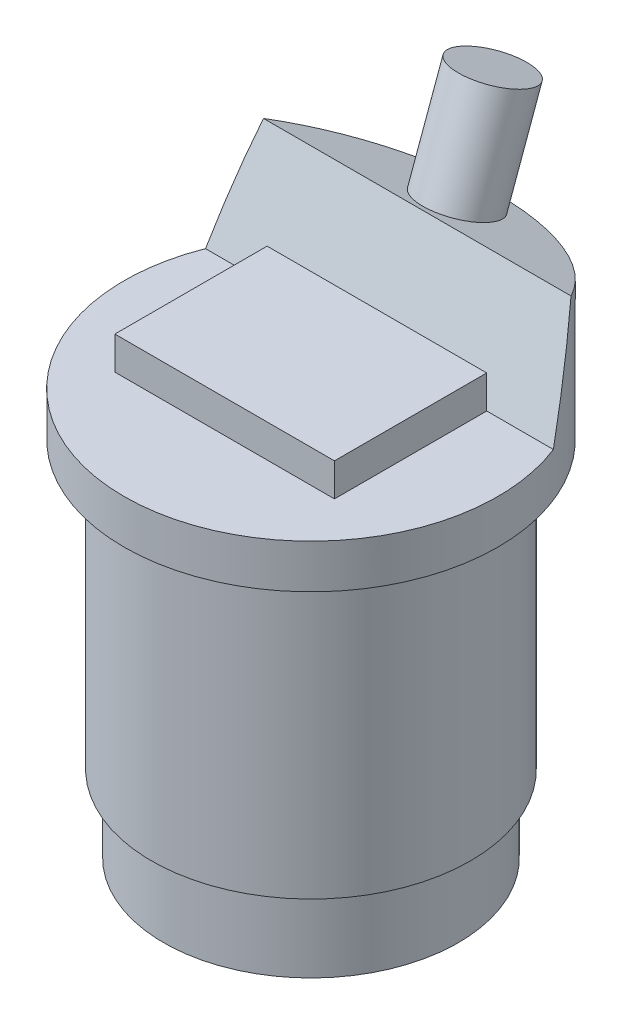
ISO-10303-21;
HEADER;
FILE_DESCRIPTION(('STEP AP214'),'2;1');
FILE_NAME('part.step','',(''),(''),'','','');
FILE_SCHEMA(('AUTOMOTIVE_DESIGN { 1 0 10303 214 1 1 1 1 }'));
ENDSEC;
DATA;
#1=APPLICATION_CONTEXT('core data for automotive mechanical design processes');
#2=APPLICATION_PROTOCOL_DEFINITION('international standard','automotive_design',2000,#1);
#3=PRODUCT_CONTEXT('',#1,'mechanical');
#4=PRODUCT('Part','Part','',(#3));
#5=PRODUCT_RELATED_PRODUCT_CATEGORY('part','',(#4));
#6=PRODUCT_DEFINITION_FORMATION('','',#4);
#7=PRODUCT_DEFINITION_CONTEXT('part definition',#1,'design');
#8=PRODUCT_DEFINITION('design','',#6,#7);
#9=PRODUCT_DEFINITION_SHAPE('','',#8);
#10=(LENGTH_UNIT() NAMED_UNIT(*) SI_UNIT(.MILLI.,.METRE.));
#11=(NAMED_UNIT(*) PLANE_ANGLE_UNIT() SI_UNIT($,.RADIAN.));
#12=(NAMED_UNIT(*) SI_UNIT($,.STERADIAN.) SOLID_ANGLE_UNIT());
#13=UNCERTAINTY_MEASURE_WITH_UNIT(LENGTH_MEASURE(1.E-05),#10,'distance_accuracy_value','');
#14=(GEOMETRIC_REPRESENTATION_CONTEXT(3) GLOBAL_UNCERTAINTY_ASSIGNED_CONTEXT((#13)) GLOBAL_UNIT_ASSIGNED_CONTEXT((#10,
#11,#12)) REPRESENTATION_CONTEXT('',''));
#15=CARTESIAN_POINT('',(0.,0.,0.));
#16=DIRECTION('',(0.,0.,1.));
#17=DIRECTION('',(1.,0.,0.));
#18=AXIS2_PLACEMENT_3D('',#15,#16,#17);
#19=CARTESIAN_POINT('',(-16.9926,9.44880000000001,-9.66208194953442));
#20=DIRECTION('',(0.,-0.939692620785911,0.342020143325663));
#21=DIRECTION('',(0.,-0.342020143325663,-0.939692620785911));
#22=AXIS2_PLACEMENT_3D('',#19,#20,#21);
#23=PLANE('',#22);
#24=CARTESIAN_POINT('',(0.,12.9655102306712,0.));
#25=DIRECTION('',(0.,-0.939692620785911,0.342020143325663));
#26=DIRECTION('',(0.,0.342020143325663,0.939692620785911));
#27=AXIS2_PLACEMENT_3D('',#24,#25,#26);
#28=ELLIPSE('',#27,18.0831472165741,16.9926);
#29=CARTESIAN_POINT('',(13.9782912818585,9.44880000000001,-9.66208194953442));
#30=VERTEX_POINT('',#29);
#31=CARTESIAN_POINT('',(-13.9782912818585,9.44880000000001,-9.66208194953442));
#32=VERTEX_POINT('',#31);
#33=EDGE_CURVE('E109',#30,#32,#28,.F.);
#34=ORIENTED_EDGE('',*,*,#33,.T.);
#35=DIRECTION('',(1.,0.,0.));
#36=VECTOR('',#35,1.);
#37=CARTESIAN_POINT('',(-16.9926,9.44880000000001,-9.66208194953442));
#38=LINE('',#37,#36);
#39=EDGE_CURVE('E112',#32,#30,#38,.T.);
#40=ORIENTED_EDGE('',*,*,#39,.T.);
#41=EDGE_LOOP('',(#34,#40));
#42=FACE_BOUND('',#41,.T.);
#43=CARTESIAN_POINT('',(0.,8.13137564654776,-13.2816756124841));
#44=DIRECTION('',(0.,-0.939692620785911,0.342020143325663));
#45=DIRECTION('',(0.,-0.342020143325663,-0.939692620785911));
#46=AXIS2_PLACEMENT_3D('',#43,#44,#45);
#47=CIRCLE('',#46,3.302);
#48=CARTESIAN_POINT('',(0.,7.00202513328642,-16.3845406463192));
#49=VERTEX_POINT('',#48);
#50=EDGE_CURVE('E11',#49,#49,#47,.F.);
#51=ORIENTED_EDGE('',*,*,#50,.F.);
#52=EDGE_LOOP('',(#51));
#53=FACE_BOUND('',#52,.T.);
#54=ADVANCED_FACE('F42',(#42,#53),#23,.F.);
#55=CARTESIAN_POINT('',(0.,0.,0.));
#56=DIRECTION('',(0.,1.,0.));
#57=DIRECTION('',(0.,0.,1.));
#58=AXIS2_PLACEMENT_3D('',#55,#56,#57);
#59=PLANE('',#58);
#60=CARTESIAN_POINT('',(0.,0.,0.));
#61=DIRECTION('',(0.,1.,0.));
#62=DIRECTION('',(0.,0.,1.));
#63=AXIS2_PLACEMENT_3D('',#60,#61,#62);
#64=CIRCLE('',#63,16.9926);
#65=CARTESIAN_POINT('',(-15.8121069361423,0.,-6.223));
#66=VERTEX_POINT('',#65);
#67=CARTESIAN_POINT('',(15.8121069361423,0.,-6.223));
#68=VERTEX_POINT('',#67);
#69=EDGE_CURVE('E129',#66,#68,#64,.T.);
#70=ORIENTED_EDGE('',*,*,#69,.T.);
#71=DIRECTION('',(1.,0.,0.));
#72=VECTOR('',#71,1.);
#73=CARTESIAN_POINT('',(15.8121069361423,0.,-6.223));
#74=LINE('',#73,#72);
#75=CARTESIAN_POINT('',(9.7536,0.,-6.223));
#76=VERTEX_POINT('',#75);
#77=EDGE_CURVE('E116',#76,#68,#74,.T.);
#78=ORIENTED_EDGE('',*,*,#77,.F.);
#79=DIRECTION('',(0.,0.,-1.));
#80=VECTOR('',#79,1.);
#81=CARTESIAN_POINT('',(9.7536,0.,-6.223));
#82=LINE('',#81,#80);
#83=CARTESIAN_POINT('',(9.75360000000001,0.,7.62));
#84=VERTEX_POINT('',#83);
#85=EDGE_CURVE('E135',#84,#76,#82,.T.);
#86=ORIENTED_EDGE('',*,*,#85,.F.);
#87=DIRECTION('',(1.,0.,0.));
#88=VECTOR('',#87,1.);
#89=CARTESIAN_POINT('',(9.75360000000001,0.,7.62));
#90=LINE('',#89,#88);
#91=CARTESIAN_POINT('',(-10.2108,0.,7.62));
#92=VERTEX_POINT('',#91);
#93=EDGE_CURVE('E140',#92,#84,#90,.T.);
#94=ORIENTED_EDGE('',*,*,#93,.F.);
#95=DIRECTION('',(0.,0.,1.));
#96=VECTOR('',#95,1.);
#97=CARTESIAN_POINT('',(-10.2108,0.,-6.223));
#98=LINE('',#97,#96);
#99=CARTESIAN_POINT('',(-10.2108,0.,-6.223));
#100=VERTEX_POINT('',#99);
#101=EDGE_CURVE('E150',#100,#92,#98,.T.);
#102=ORIENTED_EDGE('',*,*,#101,.F.);
#103=EDGE_CURVE('E133',#66,#100,#74,.T.);
#104=ORIENTED_EDGE('',*,*,#103,.F.);
#105=EDGE_LOOP('',(#70,#78,#86,#94,#102,#104));
#106=FACE_BOUND('',#105,.T.);
#107=ADVANCED_FACE('F211',(#106),#59,.T.);
#108=CARTESIAN_POINT('',(0.,-29.9466,0.));
#109=DIRECTION('',(0.,-1.,0.));
#110=DIRECTION('',(0.,0.,-1.));
#111=AXIS2_PLACEMENT_3D('',#108,#109,#110);
#112=PLANE('',#111);
#113=CARTESIAN_POINT('',(0.,-29.9466,0.));
#114=DIRECTION('',(0.,-1.,0.));
#115=DIRECTION('',(0.,0.,-1.));
#116=AXIS2_PLACEMENT_3D('',#113,#114,#115);
#117=CIRCLE('',#116,13.3985);
#118=CARTESIAN_POINT('',(0.,-29.9466,-13.3985));
#119=VERTEX_POINT('',#118);
#120=EDGE_CURVE('E166',#119,#119,#117,.T.);
#121=ORIENTED_EDGE('',*,*,#120,.F.);
#122=EDGE_LOOP('',(#121));
#123=FACE_BOUND('',#122,.T.);
#124=CARTESIAN_POINT('',(0.,-29.9466,0.));
#125=DIRECTION('',(0.,-1.,0.));
#126=DIRECTION('',(0.,0.,-1.));
#127=AXIS2_PLACEMENT_3D('',#124,#125,#126);
#128=CIRCLE('',#127,14.4907);
#129=CARTESIAN_POINT('',(-13.5001,-29.9466,-5.26570854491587));
#130=VERTEX_POINT('',#129);
#131=CARTESIAN_POINT('',(-13.5001,-29.9466,5.26570854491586));
#132=VERTEX_POINT('',#131);
#133=EDGE_CURVE('E171',#130,#132,#128,.T.);
#134=ORIENTED_EDGE('',*,*,#133,.T.);
#135=DIRECTION('',(0.,0.,-1.));
#136=VECTOR('',#135,1.);
#137=CARTESIAN_POINT('',(-13.5001,-29.9466,0.));
#138=LINE('',#137,#136);
#139=EDGE_CURVE('E162',#132,#130,#138,.T.);
#140=ORIENTED_EDGE('',*,*,#139,.T.);
#141=EDGE_LOOP('',(#134,#140));
#142=FACE_BOUND('',#141,.T.);
#143=ADVANCED_FACE('F216',(#123,#142),#112,.T.);
#144=CARTESIAN_POINT('',(0.,-29.9466,0.));
#145=DIRECTION('',(0.,1.,0.));
#146=DIRECTION('',(0.,0.,1.));
#147=AXIS2_PLACEMENT_3D('',#144,#145,#146);
#148=CYLINDRICAL_SURFACE('',#147,14.4907);
#149=DIRECTION('',(0.,1.,0.));
#150=VECTOR('',#149,1.);
#151=CARTESIAN_POINT('',(-13.5001,-29.9466,5.26570854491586));
#152=LINE('',#151,#150);
#153=CARTESIAN_POINT('',(-13.5001,-3.9878,5.26570854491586));
#154=VERTEX_POINT('',#153);
#155=EDGE_CURVE('E50',#132,#154,#152,.T.);
#156=ORIENTED_EDGE('',*,*,#155,.F.);
#157=ORIENTED_EDGE('',*,*,#133,.F.);
#158=DIRECTION('',(0.,1.,0.));
#159=VECTOR('',#158,1.);
#160=CARTESIAN_POINT('',(-13.5001,-29.9466,-5.26570854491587));
#161=LINE('',#160,#159);
#162=CARTESIAN_POINT('',(-13.5001,-3.9878,-5.26570854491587));
#163=VERTEX_POINT('',#162);
#164=EDGE_CURVE('E188',#163,#130,#161,.F.);
#165=ORIENTED_EDGE('',*,*,#164,.F.);
#166=CARTESIAN_POINT('',(0.,-3.9878,0.));
#167=DIRECTION('',(0.,1.,0.));
#168=DIRECTION('',(0.,0.,1.));
#169=AXIS2_PLACEMENT_3D('',#166,#167,#168);
#170=CIRCLE('',#169,14.4907);
#171=EDGE_CURVE('E182',#163,#154,#170,.F.);
#172=ORIENTED_EDGE('',*,*,#171,.T.);
#173=EDGE_LOOP('',(#156,#157,#165,#172));
#174=FACE_BOUND('',#173,.T.);
#175=ADVANCED_FACE('F196',(#174),#148,.T.);
#176=CARTESIAN_POINT('',(0.,-3.9878,0.));
#177=DIRECTION('',(0.,1.,0.));
#178=DIRECTION('',(0.,0.,1.));
#179=AXIS2_PLACEMENT_3D('',#176,#177,#178);
#180=PLANE('',#179);
#181=ORIENTED_EDGE('',*,*,#171,.F.);
#182=DIRECTION('',(0.,0.,1.));
#183=VECTOR('',#182,1.);
#184=CARTESIAN_POINT('',(-13.5001,-3.9878,16.8867310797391));
#185=LINE('',#184,#183);
#186=EDGE_CURVE('E64',#163,#154,#185,.T.);
#187=ORIENTED_EDGE('',*,*,#186,.T.);
#188=EDGE_LOOP('',(#181,#187));
#189=FACE_BOUND('',#188,.T.);
#190=CARTESIAN_POINT('',(0.,-3.9878,0.));
#191=DIRECTION('',(0.,1.,0.));
#192=DIRECTION('',(0.,0.,1.));
#193=AXIS2_PLACEMENT_3D('',#190,#191,#192);
#194=CIRCLE('',#193,16.9926);
#195=CARTESIAN_POINT('',(0.,-3.9878,16.9926));
#196=VERTEX_POINT('',#195);
#197=EDGE_CURVE('E178',#196,#196,#194,.T.);
#198=ORIENTED_EDGE('',*,*,#197,.F.);
#199=EDGE_LOOP('',(#198));
#200=FACE_BOUND('',#199,.T.);
#201=ADVANCED_FACE('F197',(#189,#200),#180,.F.);
#202=CARTESIAN_POINT('',(0.,-3.9878,0.));
#203=DIRECTION('',(0.,1.,0.));
#204=DIRECTION('',(0.,0.,1.));
#205=AXIS2_PLACEMENT_3D('',#202,#203,#204);
#206=CYLINDRICAL_SURFACE('',#205,16.9926);
#207=CARTESIAN_POINT('',(0.,-17.0975519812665,0.));
#208=DIRECTION('',(0.,-0.342020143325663,-0.939692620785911));
#209=DIRECTION('',(0.,0.939692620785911,-0.342020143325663));
#210=AXIS2_PLACEMENT_3D('',#207,#208,#209);
#211=ELLIPSE('',#210,49.6830386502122,16.9926);
#212=EDGE_CURVE('E117',#32,#66,#211,.F.);
#213=ORIENTED_EDGE('',*,*,#212,.F.);
#214=ORIENTED_EDGE('',*,*,#33,.F.);
#215=EDGE_CURVE('E123',#68,#30,#211,.F.);
#216=ORIENTED_EDGE('',*,*,#215,.F.);
#217=ORIENTED_EDGE('',*,*,#69,.F.);
#218=EDGE_LOOP('',(#213,#214,#216,#217));
#219=FACE_BOUND('',#218,.T.);
#220=ORIENTED_EDGE('',*,*,#197,.T.);
#221=EDGE_LOOP('',(#220));
#222=FACE_BOUND('',#221,.T.);
#223=ADVANCED_FACE('F44',(#219,#222),#206,.T.);
#224=CARTESIAN_POINT('',(0.,-36.9316,0.));
#225=DIRECTION('',(0.,1.,0.));
#226=DIRECTION('',(0.,0.,1.));
#227=AXIS2_PLACEMENT_3D('',#224,#225,#226);
#228=CYLINDRICAL_SURFACE('',#227,13.3985);
#229=CARTESIAN_POINT('',(0.,-36.9316,0.));
#230=DIRECTION('',(0.,-1.,0.));
#231=DIRECTION('',(0.,0.,-1.));
#232=AXIS2_PLACEMENT_3D('',#229,#230,#231);
#233=CIRCLE('',#232,13.3985);
#234=CARTESIAN_POINT('',(0.,-36.9316,-13.3985));
#235=VERTEX_POINT('',#234);
#236=EDGE_CURVE('E167',#235,#235,#233,.T.);
#237=ORIENTED_EDGE('',*,*,#236,.F.);
#238=EDGE_LOOP('',(#237));
#239=FACE_BOUND('',#238,.T.);
#240=ORIENTED_EDGE('',*,*,#120,.T.);
#241=EDGE_LOOP('',(#240));
#242=FACE_BOUND('',#241,.T.);
#243=ADVANCED_FACE('F203',(#239,#242),#228,.T.);
#244=CARTESIAN_POINT('',(0.,-36.9316,0.));
#245=DIRECTION('',(0.,-1.,0.));
#246=DIRECTION('',(0.,0.,-1.));
#247=AXIS2_PLACEMENT_3D('',#244,#245,#246);
#248=PLANE('',#247);
#249=ORIENTED_EDGE('',*,*,#236,.T.);
#250=EDGE_LOOP('',(#249));
#251=FACE_BOUND('',#250,.T.);
#252=ADVANCED_FACE('F207',(#251),#248,.T.);
#253=CARTESIAN_POINT('',(-13.5001,-36.9316,16.8867310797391));
#254=DIRECTION('',(-1.,0.,0.));
#255=DIRECTION('',(0.,0.,1.));
#256=AXIS2_PLACEMENT_3D('',#253,#254,#255);
#257=PLANE('',#256);
#258=ORIENTED_EDGE('',*,*,#155,.T.);
#259=ORIENTED_EDGE('',*,*,#186,.F.);
#260=ORIENTED_EDGE('',*,*,#164,.T.);
#261=ORIENTED_EDGE('',*,*,#139,.F.);
#262=EDGE_LOOP('',(#258,#259,#260,#261));
#263=FACE_BOUND('',#262,.T.);
#264=ADVANCED_FACE('F192',(#263),#257,.T.);
#265=CARTESIAN_POINT('',(9.7536,2.99720000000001,-6.223));
#266=DIRECTION('',(-1.,0.,0.));
#267=DIRECTION('',(0.,0.,1.));
#268=AXIS2_PLACEMENT_3D('',#265,#266,#267);
#269=PLANE('',#268);
#270=ORIENTED_EDGE('',*,*,#85,.T.);
#271=DIRECTION('',(0.,-1.,0.));
#272=VECTOR('',#271,1.);
#273=CARTESIAN_POINT('',(9.7536,2.99720000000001,-6.223));
#274=LINE('',#273,#272);
#275=CARTESIAN_POINT('',(9.75360000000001,2.99720000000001,-6.223));
#276=VERTEX_POINT('',#275);
#277=EDGE_CURVE('E159',#276,#76,#274,.T.);
#278=ORIENTED_EDGE('',*,*,#277,.F.);
#279=DIRECTION('',(0.,0.,-1.));
#280=VECTOR('',#279,1.);
#281=CARTESIAN_POINT('',(9.7536,2.99720000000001,-6.223));
#282=LINE('',#281,#280);
#283=CARTESIAN_POINT('',(9.75360000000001,2.99720000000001,7.62));
#284=VERTEX_POINT('',#283);
#285=EDGE_CURVE('E136',#284,#276,#282,.T.);
#286=ORIENTED_EDGE('',*,*,#285,.F.);
#287=DIRECTION('',(0.,-1.,0.));
#288=VECTOR('',#287,1.);
#289=CARTESIAN_POINT('',(9.75360000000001,2.99720000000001,7.62));
#290=LINE('',#289,#288);
#291=EDGE_CURVE('E147',#284,#84,#290,.T.);
#292=ORIENTED_EDGE('',*,*,#291,.T.);
#293=EDGE_LOOP('',(#270,#278,#286,#292));
#294=FACE_BOUND('',#293,.T.);
#295=ADVANCED_FACE('F238',(#294),#269,.F.);
#296=CARTESIAN_POINT('',(-10.2108,2.99720000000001,-6.223));
#297=DIRECTION('',(1.,0.,0.));
#298=DIRECTION('',(0.,0.,-1.));
#299=AXIS2_PLACEMENT_3D('',#296,#297,#298);
#300=PLANE('',#299);
#301=ORIENTED_EDGE('',*,*,#101,.T.);
#302=DIRECTION('',(0.,-1.,0.));
#303=VECTOR('',#302,1.);
#304=CARTESIAN_POINT('',(-10.2108,2.99720000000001,7.62));
#305=LINE('',#304,#303);
#306=CARTESIAN_POINT('',(-10.2108,2.99720000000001,7.62));
#307=VERTEX_POINT('',#306);
#308=EDGE_CURVE('E57',#307,#92,#305,.T.);
#309=ORIENTED_EDGE('',*,*,#308,.F.);
#310=DIRECTION('',(0.,0.,1.));
#311=VECTOR('',#310,1.);
#312=CARTESIAN_POINT('',(-10.2108,2.99720000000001,-6.223));
#313=LINE('',#312,#311);
#314=CARTESIAN_POINT('',(-10.2108,2.99720000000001,-6.223));
#315=VERTEX_POINT('',#314);
#316=EDGE_CURVE('E143',#315,#307,#313,.T.);
#317=ORIENTED_EDGE('',*,*,#316,.F.);
#318=DIRECTION('',(0.,-1.,0.));
#319=VECTOR('',#318,1.);
#320=CARTESIAN_POINT('',(-10.2108,2.99720000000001,-6.223));
#321=LINE('',#320,#319);
#322=EDGE_CURVE('E156',#315,#100,#321,.T.);
#323=ORIENTED_EDGE('',*,*,#322,.T.);
#324=EDGE_LOOP('',(#301,#309,#317,#323));
#325=FACE_BOUND('',#324,.T.);
#326=ADVANCED_FACE('F235',(#325),#300,.F.);
#327=CARTESIAN_POINT('',(9.75360000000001,2.99720000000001,7.62));
#328=DIRECTION('',(0.,0.,-1.));
#329=DIRECTION('',(-1.,0.,0.));
#330=AXIS2_PLACEMENT_3D('',#327,#328,#329);
#331=PLANE('',#330);
#332=ORIENTED_EDGE('',*,*,#93,.T.);
#333=ORIENTED_EDGE('',*,*,#291,.F.);
#334=DIRECTION('',(1.,0.,0.));
#335=VECTOR('',#334,1.);
#336=CARTESIAN_POINT('',(9.75360000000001,2.99720000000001,7.62));
#337=LINE('',#336,#335);
#338=EDGE_CURVE('E145',#307,#284,#337,.T.);
#339=ORIENTED_EDGE('',*,*,#338,.F.);
#340=ORIENTED_EDGE('',*,*,#308,.T.);
#341=EDGE_LOOP('',(#332,#333,#339,#340));
#342=FACE_BOUND('',#341,.T.);
#343=ADVANCED_FACE('F231',(#342),#331,.F.);
#344=CARTESIAN_POINT('',(9.75360000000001,2.99720000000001,7.62));
#345=DIRECTION('',(0.,-1.,0.));
#346=DIRECTION('',(0.,0.,-1.));
#347=AXIS2_PLACEMENT_3D('',#344,#345,#346);
#348=PLANE('',#347);
#349=ORIENTED_EDGE('',*,*,#285,.T.);
#350=DIRECTION('',(-1.,0.,0.));
#351=VECTOR('',#350,1.);
#352=CARTESIAN_POINT('',(9.7536,2.99720000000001,-6.223));
#353=LINE('',#352,#351);
#354=EDGE_CURVE('E139',#276,#315,#353,.T.);
#355=ORIENTED_EDGE('',*,*,#354,.T.);
#356=ORIENTED_EDGE('',*,*,#316,.T.);
#357=ORIENTED_EDGE('',*,*,#338,.T.);
#358=EDGE_LOOP('',(#349,#355,#356,#357));
#359=FACE_BOUND('',#358,.T.);
#360=ADVANCED_FACE('F227',(#359),#348,.F.);
#361=CARTESIAN_POINT('',(-16.9926,15.2198630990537,-6.223));
#362=DIRECTION('',(0.,0.,1.));
#363=DIRECTION('',(1.,0.,0.));
#364=AXIS2_PLACEMENT_3D('',#361,#362,#363);
#365=PLANE('',#364);
#366=DIRECTION('',(1.,0.,0.));
#367=VECTOR('',#366,1.);
#368=CARTESIAN_POINT('',(-16.9926,0.,-6.223));
#369=LINE('',#368,#367);
#370=EDGE_CURVE('E124',#100,#76,#369,.T.);
#371=ORIENTED_EDGE('',*,*,#370,.F.);
#372=ORIENTED_EDGE('',*,*,#322,.F.);
#373=ORIENTED_EDGE('',*,*,#354,.F.);
#374=ORIENTED_EDGE('',*,*,#277,.T.);
#375=EDGE_LOOP('',(#371,#372,#373,#374));
#376=FACE_BOUND('',#375,.T.);
#377=ADVANCED_FACE('F224',(#376),#365,.F.);
#378=CARTESIAN_POINT('',(-16.9926,0.,-6.223));
#379=DIRECTION('',(0.,-0.342020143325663,-0.939692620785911));
#380=DIRECTION('',(0.,0.939692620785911,-0.342020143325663));
#381=AXIS2_PLACEMENT_3D('',#378,#379,#380);
#382=PLANE('',#381);
#383=ORIENTED_EDGE('',*,*,#212,.T.);
#384=ORIENTED_EDGE('',*,*,#103,.T.);
#385=ORIENTED_EDGE('',*,*,#370,.T.);
#386=ORIENTED_EDGE('',*,*,#77,.T.);
#387=ORIENTED_EDGE('',*,*,#215,.T.);
#388=ORIENTED_EDGE('',*,*,#39,.F.);
#389=EDGE_LOOP('',(#383,#384,#385,#386,#387,#388));
#390=FACE_BOUND('',#389,.T.);
#391=ADVANCED_FACE('F120',(#390),#382,.F.);
#392=CARTESIAN_POINT('',(0.,17.0103432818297,-16.5133555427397));
#393=DIRECTION('',(0.,-0.939692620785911,0.342020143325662));
#394=DIRECTION('',(0.,-0.342020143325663,-0.939692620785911));
#395=AXIS2_PLACEMENT_3D('',#392,#393,#394);
#396=CYLINDRICAL_SURFACE('',#395,3.302);
#397=CARTESIAN_POINT('',(0.,17.0103432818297,-16.5133555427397));
#398=DIRECTION('',(0.,0.939692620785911,-0.342020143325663));
#399=DIRECTION('',(0.,0.342020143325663,0.939692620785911));
#400=AXIS2_PLACEMENT_3D('',#397,#398,#399);
#401=CIRCLE('',#400,3.302);
#402=CARTESIAN_POINT('',(0.,18.139693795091,-13.4104905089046));
#403=VERTEX_POINT('',#402);
#404=EDGE_CURVE('E346',#403,#403,#401,.T.);
#405=ORIENTED_EDGE('',*,*,#404,.F.);
#406=EDGE_LOOP('',(#405));
#407=FACE_BOUND('',#406,.T.);
#408=ORIENTED_EDGE('',*,*,#50,.T.);
#409=EDGE_LOOP('',(#408));
#410=FACE_BOUND('',#409,.T.);
#411=ADVANCED_FACE('F220',(#407,#410),#396,.T.);
#412=CARTESIAN_POINT('',(0.,17.0103432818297,-16.5133555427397));
#413=DIRECTION('',(0.,0.939692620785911,-0.342020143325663));
#414=DIRECTION('',(0.,0.342020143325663,0.939692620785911));
#415=AXIS2_PLACEMENT_3D('',#412,#413,#414);
#416=PLANE('',#415);
#417=ORIENTED_EDGE('',*,*,#404,.T.);
#418=EDGE_LOOP('',(#417));
#419=FACE_BOUND('',#418,.T.);
#420=ADVANCED_FACE('F332',(#419),#416,.T.);
#421=CLOSED_SHELL('',(#54,#107,#143,#175,#201,#223,#243,#252,#264,#295,#326,#343,#360,#377,#391,
#411,#420));
#422=MANIFOLD_SOLID_BREP('B2',#421);
#423=ADVANCED_BREP_SHAPE_REPRESENTATION('',(#18,#422),#14);
#424=SHAPE_DEFINITION_REPRESENTATION(#9,#423);
ENDSEC;
END-ISO-10303-21;
